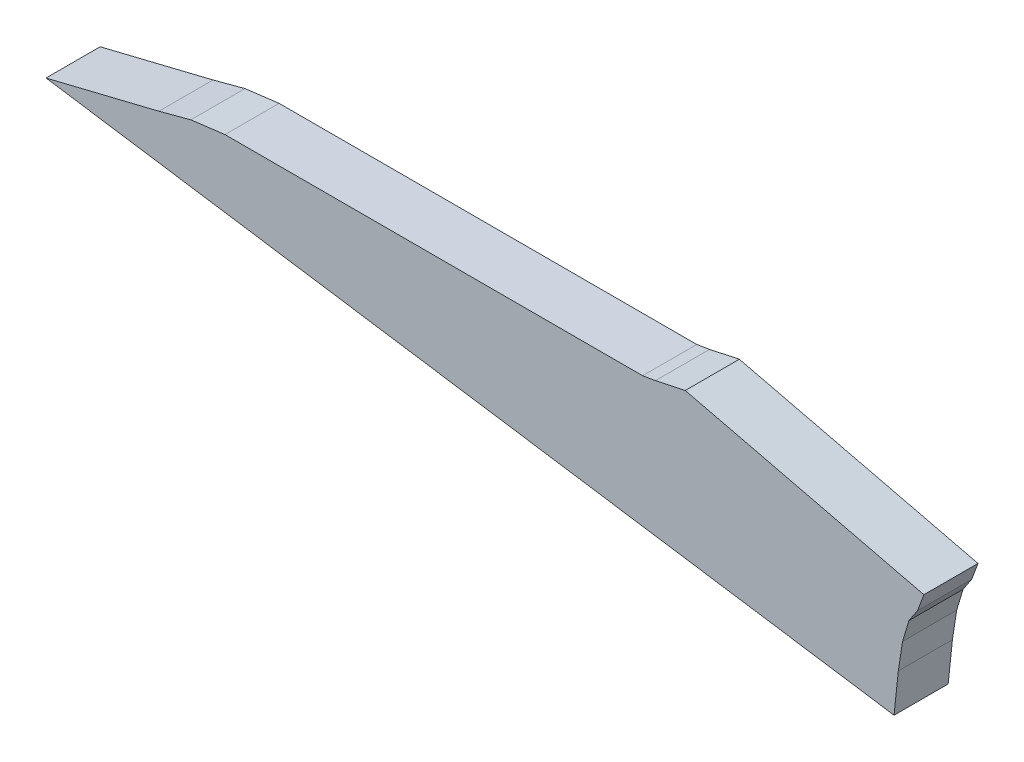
ISO-10303-21;
HEADER;
FILE_DESCRIPTION(('STEP AP214'),'2;1');
FILE_NAME('part.step','',(''),(''),'','','');
FILE_SCHEMA(('AUTOMOTIVE_DESIGN { 1 0 10303 214 1 1 1 1 }'));
ENDSEC;
DATA;
#1=APPLICATION_CONTEXT('core data for automotive mechanical design processes');
#2=APPLICATION_PROTOCOL_DEFINITION('international standard','automotive_design',2000,#1);
#3=PRODUCT_CONTEXT('',#1,'mechanical');
#4=PRODUCT('Part','Part','',(#3));
#5=PRODUCT_RELATED_PRODUCT_CATEGORY('part','',(#4));
#6=PRODUCT_DEFINITION_FORMATION('','',#4);
#7=PRODUCT_DEFINITION_CONTEXT('part definition',#1,'design');
#8=PRODUCT_DEFINITION('design','',#6,#7);
#9=PRODUCT_DEFINITION_SHAPE('','',#8);
#10=(LENGTH_UNIT() NAMED_UNIT(*) SI_UNIT(.MILLI.,.METRE.));
#11=(NAMED_UNIT(*) PLANE_ANGLE_UNIT() SI_UNIT($,.RADIAN.));
#12=(NAMED_UNIT(*) SI_UNIT($,.STERADIAN.) SOLID_ANGLE_UNIT());
#13=UNCERTAINTY_MEASURE_WITH_UNIT(LENGTH_MEASURE(1.E-05),#10,'distance_accuracy_value','');
#14=(GEOMETRIC_REPRESENTATION_CONTEXT(3) GLOBAL_UNCERTAINTY_ASSIGNED_CONTEXT((#13)) GLOBAL_UNIT_ASSIGNED_CONTEXT((#10,
#11,#12)) REPRESENTATION_CONTEXT('',''));
#15=CARTESIAN_POINT('',(0.,0.,0.));
#16=DIRECTION('',(0.,0.,1.));
#17=DIRECTION('',(1.,0.,0.));
#18=AXIS2_PLACEMENT_3D('',#15,#16,#17);
#19=CARTESIAN_POINT('',(329.,139.,-17.));
#20=DIRECTION('',(-0.238221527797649,0.971210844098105,0.));
#21=DIRECTION('',(-0.971210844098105,-0.238221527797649,0.));
#22=AXIS2_PLACEMENT_3D('',#19,#20,#21);
#23=PLANE('',#22);
#24=DIRECTION('',(-0.971210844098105,-0.238221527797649,0.));
#25=VECTOR('',#24,1.);
#26=CARTESIAN_POINT('',(329.,139.,8.4));
#27=LINE('',#26,#25);
#28=CARTESIAN_POINT('',(329.,139.,8.4));
#29=VERTEX_POINT('',#28);
#30=CARTESIAN_POINT('',(276.,126.,8.4));
#31=VERTEX_POINT('',#30);
#32=EDGE_CURVE('E159',#29,#31,#27,.T.);
#33=ORIENTED_EDGE('',*,*,#32,.F.);
#34=DIRECTION('',(0.,0.,1.));
#35=VECTOR('',#34,1.);
#36=CARTESIAN_POINT('',(329.,139.,-17.));
#37=LINE('',#36,#35);
#38=CARTESIAN_POINT('',(329.,139.,-17.));
#39=VERTEX_POINT('',#38);
#40=EDGE_CURVE('E11',#39,#29,#37,.T.);
#41=ORIENTED_EDGE('',*,*,#40,.F.);
#42=DIRECTION('',(-0.971210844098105,-0.238221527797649,0.));
#43=VECTOR('',#42,1.);
#44=CARTESIAN_POINT('',(329.,139.,-17.));
#45=LINE('',#44,#43);
#46=CARTESIAN_POINT('',(276.,126.,-17.));
#47=VERTEX_POINT('',#46);
#48=EDGE_CURVE('E194',#39,#47,#45,.T.);
#49=ORIENTED_EDGE('',*,*,#48,.T.);
#50=DIRECTION('',(0.,0.,1.));
#51=VECTOR('',#50,1.);
#52=CARTESIAN_POINT('',(276.,126.,-17.));
#53=LINE('',#52,#51);
#54=EDGE_CURVE('E35',#47,#31,#53,.T.);
#55=ORIENTED_EDGE('',*,*,#54,.T.);
#56=EDGE_LOOP('',(#33,#41,#49,#55));
#57=FACE_BOUND('',#56,.T.);
#58=ADVANCED_FACE('F32',(#57),#23,.T.);
#59=CARTESIAN_POINT('',(344.,143.,-17.));
#60=DIRECTION('',(-0.257662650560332,0.966234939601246,0.));
#61=DIRECTION('',(-0.966234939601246,-0.257662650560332,0.));
#62=AXIS2_PLACEMENT_3D('',#59,#60,#61);
#63=PLANE('',#62);
#64=DIRECTION('',(-0.966234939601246,-0.257662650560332,0.));
#65=VECTOR('',#64,1.);
#66=CARTESIAN_POINT('',(344.,143.,8.4));
#67=LINE('',#66,#65);
#68=CARTESIAN_POINT('',(344.,143.,8.4));
#69=VERTEX_POINT('',#68);
#70=EDGE_CURVE('E192',#69,#29,#67,.T.);
#71=ORIENTED_EDGE('',*,*,#70,.F.);
#72=DIRECTION('',(0.,0.,1.));
#73=VECTOR('',#72,1.);
#74=CARTESIAN_POINT('',(344.,143.,-17.));
#75=LINE('',#74,#73);
#76=CARTESIAN_POINT('',(344.,143.,-17.));
#77=VERTEX_POINT('',#76);
#78=EDGE_CURVE('E41',#77,#69,#75,.T.);
#79=ORIENTED_EDGE('',*,*,#78,.F.);
#80=DIRECTION('',(-0.966234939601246,-0.257662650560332,0.));
#81=VECTOR('',#80,1.);
#82=CARTESIAN_POINT('',(344.,143.,-17.));
#83=LINE('',#82,#81);
#84=EDGE_CURVE('E149',#77,#39,#83,.T.);
#85=ORIENTED_EDGE('',*,*,#84,.T.);
#86=ORIENTED_EDGE('',*,*,#40,.T.);
#87=EDGE_LOOP('',(#71,#79,#85,#86));
#88=FACE_BOUND('',#87,.T.);
#89=ADVANCED_FACE('F216',(#88),#63,.T.);
#90=CARTESIAN_POINT('',(360.,145.,-17.));
#91=DIRECTION('',(-0.124034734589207,0.992277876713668,0.));
#92=DIRECTION('',(-0.992277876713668,-0.124034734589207,0.));
#93=AXIS2_PLACEMENT_3D('',#90,#91,#92);
#94=PLANE('',#93);
#95=DIRECTION('',(-0.992277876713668,-0.124034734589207,0.));
#96=VECTOR('',#95,1.);
#97=CARTESIAN_POINT('',(360.,145.,8.4));
#98=LINE('',#97,#96);
#99=CARTESIAN_POINT('',(360.,145.,8.4));
#100=VERTEX_POINT('',#99);
#101=EDGE_CURVE('E136',#100,#69,#98,.T.);
#102=ORIENTED_EDGE('',*,*,#101,.F.);
#103=DIRECTION('',(0.,0.,1.));
#104=VECTOR('',#103,1.);
#105=CARTESIAN_POINT('',(360.,145.,-17.));
#106=LINE('',#105,#104);
#107=CARTESIAN_POINT('',(360.,145.,-17.));
#108=VERTEX_POINT('',#107);
#109=EDGE_CURVE('E131',#108,#100,#106,.T.);
#110=ORIENTED_EDGE('',*,*,#109,.F.);
#111=DIRECTION('',(-0.992277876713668,-0.124034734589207,0.));
#112=VECTOR('',#111,1.);
#113=CARTESIAN_POINT('',(360.,145.,-17.));
#114=LINE('',#113,#112);
#115=EDGE_CURVE('E134',#108,#77,#114,.T.);
#116=ORIENTED_EDGE('',*,*,#115,.T.);
#117=ORIENTED_EDGE('',*,*,#78,.T.);
#118=EDGE_LOOP('',(#102,#110,#116,#117));
#119=FACE_BOUND('',#118,.T.);
#120=ADVANCED_FACE('F133',(#119),#94,.T.);
#121=CARTESIAN_POINT('',(556.,145.,-17.));
#122=DIRECTION('',(0.,1.,0.));
#123=DIRECTION('',(0.,0.,1.));
#124=AXIS2_PLACEMENT_3D('',#121,#122,#123);
#125=PLANE('',#124);
#126=DIRECTION('',(-1.,0.,0.));
#127=VECTOR('',#126,1.);
#128=CARTESIAN_POINT('',(556.,145.,8.4));
#129=LINE('',#128,#127);
#130=CARTESIAN_POINT('',(556.,145.,8.4));
#131=VERTEX_POINT('',#130);
#132=EDGE_CURVE('E189',#131,#100,#129,.T.);
#133=ORIENTED_EDGE('',*,*,#132,.F.);
#134=DIRECTION('',(0.,0.,1.));
#135=VECTOR('',#134,1.);
#136=CARTESIAN_POINT('',(556.,145.,-17.));
#137=LINE('',#136,#135);
#138=CARTESIAN_POINT('',(556.,145.,-17.));
#139=VERTEX_POINT('',#138);
#140=EDGE_CURVE('E141',#139,#131,#137,.T.);
#141=ORIENTED_EDGE('',*,*,#140,.F.);
#142=DIRECTION('',(-1.,0.,0.));
#143=VECTOR('',#142,1.);
#144=CARTESIAN_POINT('',(556.,145.,-17.));
#145=LINE('',#144,#143);
#146=EDGE_CURVE('E147',#139,#108,#145,.T.);
#147=ORIENTED_EDGE('',*,*,#146,.T.);
#148=ORIENTED_EDGE('',*,*,#109,.T.);
#149=EDGE_LOOP('',(#133,#141,#147,#148));
#150=FACE_BOUND('',#149,.T.);
#151=ADVANCED_FACE('F151',(#150),#125,.T.);
#152=CARTESIAN_POINT('',(562.,146.,-17.));
#153=DIRECTION('',(-0.164398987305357,0.986393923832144,0.));
#154=DIRECTION('',(-0.986393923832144,-0.164398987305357,0.));
#155=AXIS2_PLACEMENT_3D('',#152,#153,#154);
#156=PLANE('',#155);
#157=DIRECTION('',(-0.986393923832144,-0.164398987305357,0.));
#158=VECTOR('',#157,1.);
#159=CARTESIAN_POINT('',(562.,146.,8.4));
#160=LINE('',#159,#158);
#161=CARTESIAN_POINT('',(562.,146.,8.4));
#162=VERTEX_POINT('',#161);
#163=EDGE_CURVE('E186',#162,#131,#160,.T.);
#164=ORIENTED_EDGE('',*,*,#163,.F.);
#165=DIRECTION('',(0.,0.,1.));
#166=VECTOR('',#165,1.);
#167=CARTESIAN_POINT('',(562.,146.,-17.));
#168=LINE('',#167,#166);
#169=CARTESIAN_POINT('',(562.,146.,-17.));
#170=VERTEX_POINT('',#169);
#171=EDGE_CURVE('E198',#170,#162,#168,.T.);
#172=ORIENTED_EDGE('',*,*,#171,.F.);
#173=DIRECTION('',(-0.986393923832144,-0.164398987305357,0.));
#174=VECTOR('',#173,1.);
#175=CARTESIAN_POINT('',(562.,146.,-17.));
#176=LINE('',#175,#174);
#177=EDGE_CURVE('E152',#170,#139,#176,.T.);
#178=ORIENTED_EDGE('',*,*,#177,.T.);
#179=ORIENTED_EDGE('',*,*,#140,.T.);
#180=EDGE_LOOP('',(#164,#172,#178,#179));
#181=FACE_BOUND('',#180,.T.);
#182=ADVANCED_FACE('F229',(#181),#156,.T.);
#183=CARTESIAN_POINT('',(576.,149.,-17.));
#184=DIRECTION('',(-0.209529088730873,0.97780241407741,0.));
#185=DIRECTION('',(-0.97780241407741,-0.209529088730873,0.));
#186=AXIS2_PLACEMENT_3D('',#183,#184,#185);
#187=PLANE('',#186);
#188=DIRECTION('',(-0.97780241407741,-0.209529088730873,0.));
#189=VECTOR('',#188,1.);
#190=CARTESIAN_POINT('',(576.,149.,8.4));
#191=LINE('',#190,#189);
#192=CARTESIAN_POINT('',(576.,149.,8.4));
#193=VERTEX_POINT('',#192);
#194=EDGE_CURVE('E183',#193,#162,#191,.T.);
#195=ORIENTED_EDGE('',*,*,#194,.F.);
#196=DIRECTION('',(0.,0.,1.));
#197=VECTOR('',#196,1.);
#198=CARTESIAN_POINT('',(576.,149.,-17.));
#199=LINE('',#198,#197);
#200=CARTESIAN_POINT('',(576.,149.,-17.));
#201=VERTEX_POINT('',#200);
#202=EDGE_CURVE('E200',#201,#193,#199,.T.);
#203=ORIENTED_EDGE('',*,*,#202,.F.);
#204=DIRECTION('',(-0.97780241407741,-0.209529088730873,0.));
#205=VECTOR('',#204,1.);
#206=CARTESIAN_POINT('',(576.,149.,-17.));
#207=LINE('',#206,#205);
#208=EDGE_CURVE('E154',#201,#170,#207,.T.);
#209=ORIENTED_EDGE('',*,*,#208,.T.);
#210=ORIENTED_EDGE('',*,*,#171,.T.);
#211=EDGE_LOOP('',(#195,#203,#209,#210));
#212=FACE_BOUND('',#211,.T.);
#213=ADVANCED_FACE('F232',(#212),#187,.T.);
#214=CARTESIAN_POINT('',(688.,122.,-17.));
#215=DIRECTION('',(0.234357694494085,0.972150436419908,0.));
#216=DIRECTION('',(-0.972150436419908,0.234357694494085,0.));
#217=AXIS2_PLACEMENT_3D('',#214,#215,#216);
#218=PLANE('',#217);
#219=DIRECTION('',(-0.972150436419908,0.234357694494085,0.));
#220=VECTOR('',#219,1.);
#221=CARTESIAN_POINT('',(688.,122.,8.4));
#222=LINE('',#221,#220);
#223=CARTESIAN_POINT('',(688.,122.,8.4));
#224=VERTEX_POINT('',#223);
#225=EDGE_CURVE('E180',#224,#193,#222,.T.);
#226=ORIENTED_EDGE('',*,*,#225,.F.);
#227=DIRECTION('',(0.,0.,1.));
#228=VECTOR('',#227,1.);
#229=CARTESIAN_POINT('',(688.,122.,-17.));
#230=LINE('',#229,#228);
#231=CARTESIAN_POINT('',(688.,122.,-17.));
#232=VERTEX_POINT('',#231);
#233=EDGE_CURVE('E202',#232,#224,#230,.T.);
#234=ORIENTED_EDGE('',*,*,#233,.F.);
#235=DIRECTION('',(-0.972150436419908,0.234357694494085,0.));
#236=VECTOR('',#235,1.);
#237=CARTESIAN_POINT('',(688.,122.,-17.));
#238=LINE('',#237,#236);
#239=EDGE_CURVE('E372',#232,#201,#238,.T.);
#240=ORIENTED_EDGE('',*,*,#239,.T.);
#241=ORIENTED_EDGE('',*,*,#202,.T.);
#242=EDGE_LOOP('',(#226,#234,#240,#241));
#243=FACE_BOUND('',#242,.T.);
#244=ADVANCED_FACE('F236',(#243),#218,.T.);
#245=CARTESIAN_POINT('',(685.,114.,-17.));
#246=DIRECTION('',(0.936329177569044,-0.351123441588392,0.));
#247=DIRECTION('',(0.351123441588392,0.936329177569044,0.));
#248=AXIS2_PLACEMENT_3D('',#245,#246,#247);
#249=PLANE('',#248);
#250=DIRECTION('',(0.351123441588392,0.936329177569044,0.));
#251=VECTOR('',#250,1.);
#252=CARTESIAN_POINT('',(685.,114.,8.4));
#253=LINE('',#252,#251);
#254=CARTESIAN_POINT('',(685.,114.,8.4));
#255=VERTEX_POINT('',#254);
#256=EDGE_CURVE('E177',#255,#224,#253,.T.);
#257=ORIENTED_EDGE('',*,*,#256,.F.);
#258=DIRECTION('',(0.,0.,1.));
#259=VECTOR('',#258,1.);
#260=CARTESIAN_POINT('',(685.,114.,-17.));
#261=LINE('',#260,#259);
#262=CARTESIAN_POINT('',(685.,114.,-17.));
#263=VERTEX_POINT('',#262);
#264=EDGE_CURVE('E204',#263,#255,#261,.T.);
#265=ORIENTED_EDGE('',*,*,#264,.F.);
#266=DIRECTION('',(0.351123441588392,0.936329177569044,0.));
#267=VECTOR('',#266,1.);
#268=CARTESIAN_POINT('',(685.,114.,-17.));
#269=LINE('',#268,#267);
#270=EDGE_CURVE('E368',#263,#232,#269,.T.);
#271=ORIENTED_EDGE('',*,*,#270,.T.);
#272=ORIENTED_EDGE('',*,*,#233,.T.);
#273=EDGE_LOOP('',(#257,#265,#271,#272));
#274=FACE_BOUND('',#273,.T.);
#275=ADVANCED_FACE('F240',(#274),#249,.T.);
#276=CARTESIAN_POINT('',(681.,108.,-17.));
#277=DIRECTION('',(0.832050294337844,-0.554700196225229,0.));
#278=DIRECTION('',(0.554700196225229,0.832050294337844,0.));
#279=AXIS2_PLACEMENT_3D('',#276,#277,#278);
#280=PLANE('',#279);
#281=DIRECTION('',(0.554700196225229,0.832050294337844,0.));
#282=VECTOR('',#281,1.);
#283=CARTESIAN_POINT('',(681.,108.,8.4));
#284=LINE('',#283,#282);
#285=CARTESIAN_POINT('',(681.,108.,8.4));
#286=VERTEX_POINT('',#285);
#287=EDGE_CURVE('E174',#286,#255,#284,.T.);
#288=ORIENTED_EDGE('',*,*,#287,.F.);
#289=DIRECTION('',(0.,0.,1.));
#290=VECTOR('',#289,1.);
#291=CARTESIAN_POINT('',(681.,108.,-17.));
#292=LINE('',#291,#290);
#293=CARTESIAN_POINT('',(681.,108.,-17.));
#294=VERTEX_POINT('',#293);
#295=EDGE_CURVE('E206',#294,#286,#292,.T.);
#296=ORIENTED_EDGE('',*,*,#295,.F.);
#297=DIRECTION('',(0.554700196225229,0.832050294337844,0.));
#298=VECTOR('',#297,1.);
#299=CARTESIAN_POINT('',(681.,108.,-17.));
#300=LINE('',#299,#298);
#301=EDGE_CURVE('E379',#294,#263,#300,.T.);
#302=ORIENTED_EDGE('',*,*,#301,.T.);
#303=ORIENTED_EDGE('',*,*,#264,.T.);
#304=EDGE_LOOP('',(#288,#296,#302,#303));
#305=FACE_BOUND('',#304,.T.);
#306=ADVANCED_FACE('F244',(#305),#280,.T.);
#307=CARTESIAN_POINT('',(678.,98.,-17.));
#308=DIRECTION('',(0.957826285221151,-0.287347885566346,0.));
#309=DIRECTION('',(0.287347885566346,0.957826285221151,0.));
#310=AXIS2_PLACEMENT_3D('',#307,#308,#309);
#311=PLANE('',#310);
#312=DIRECTION('',(0.287347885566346,0.957826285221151,0.));
#313=VECTOR('',#312,1.);
#314=CARTESIAN_POINT('',(678.,98.,8.4));
#315=LINE('',#314,#313);
#316=CARTESIAN_POINT('',(678.,98.,8.4));
#317=VERTEX_POINT('',#316);
#318=EDGE_CURVE('E171',#317,#286,#315,.T.);
#319=ORIENTED_EDGE('',*,*,#318,.F.);
#320=DIRECTION('',(0.,0.,1.));
#321=VECTOR('',#320,1.);
#322=CARTESIAN_POINT('',(678.,98.,-17.));
#323=LINE('',#322,#321);
#324=CARTESIAN_POINT('',(678.,98.,-17.));
#325=VERTEX_POINT('',#324);
#326=EDGE_CURVE('E208',#325,#317,#323,.T.);
#327=ORIENTED_EDGE('',*,*,#326,.F.);
#328=DIRECTION('',(0.287347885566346,0.957826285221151,0.));
#329=VECTOR('',#328,1.);
#330=CARTESIAN_POINT('',(678.,98.,-17.));
#331=LINE('',#330,#329);
#332=EDGE_CURVE('E361',#325,#294,#331,.T.);
#333=ORIENTED_EDGE('',*,*,#332,.T.);
#334=ORIENTED_EDGE('',*,*,#295,.T.);
#335=EDGE_LOOP('',(#319,#327,#333,#334));
#336=FACE_BOUND('',#335,.T.);
#337=ADVANCED_FACE('F248',(#336),#311,.T.);
#338=CARTESIAN_POINT('',(676.,85.,-17.));
#339=DIRECTION('',(0.988371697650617,-0.152057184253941,0.));
#340=DIRECTION('',(0.152057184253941,0.988371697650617,0.));
#341=AXIS2_PLACEMENT_3D('',#338,#339,#340);
#342=PLANE('',#341);
#343=DIRECTION('',(0.152057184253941,0.988371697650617,0.));
#344=VECTOR('',#343,1.);
#345=CARTESIAN_POINT('',(676.,85.,8.4));
#346=LINE('',#345,#344);
#347=CARTESIAN_POINT('',(676.,85.,8.4));
#348=VERTEX_POINT('',#347);
#349=EDGE_CURVE('E168',#348,#317,#346,.T.);
#350=ORIENTED_EDGE('',*,*,#349,.F.);
#351=DIRECTION('',(0.,0.,1.));
#352=VECTOR('',#351,1.);
#353=CARTESIAN_POINT('',(676.,85.,-17.));
#354=LINE('',#353,#352);
#355=CARTESIAN_POINT('',(676.,85.,-17.));
#356=VERTEX_POINT('',#355);
#357=EDGE_CURVE('E210',#356,#348,#354,.T.);
#358=ORIENTED_EDGE('',*,*,#357,.F.);
#359=DIRECTION('',(0.152057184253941,0.988371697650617,0.));
#360=VECTOR('',#359,1.);
#361=CARTESIAN_POINT('',(676.,85.,-17.));
#362=LINE('',#361,#360);
#363=EDGE_CURVE('E357',#356,#325,#362,.T.);
#364=ORIENTED_EDGE('',*,*,#363,.T.);
#365=ORIENTED_EDGE('',*,*,#326,.T.);
#366=EDGE_LOOP('',(#350,#358,#364,#365));
#367=FACE_BOUND('',#366,.T.);
#368=ADVANCED_FACE('F252',(#367),#342,.T.);
#369=CARTESIAN_POINT('',(674.,66.,-17.));
#370=DIRECTION('',(0.994505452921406,-0.104684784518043,0.));
#371=DIRECTION('',(0.104684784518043,0.994505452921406,0.));
#372=AXIS2_PLACEMENT_3D('',#369,#370,#371);
#373=PLANE('',#372);
#374=DIRECTION('',(0.104684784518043,0.994505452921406,0.));
#375=VECTOR('',#374,1.);
#376=CARTESIAN_POINT('',(674.,66.,8.4));
#377=LINE('',#376,#375);
#378=CARTESIAN_POINT('',(674.,66.,8.4));
#379=VERTEX_POINT('',#378);
#380=EDGE_CURVE('E165',#379,#348,#377,.T.);
#381=ORIENTED_EDGE('',*,*,#380,.F.);
#382=DIRECTION('',(0.,0.,1.));
#383=VECTOR('',#382,1.);
#384=CARTESIAN_POINT('',(674.,66.,-17.));
#385=LINE('',#384,#383);
#386=CARTESIAN_POINT('',(674.,66.,-17.));
#387=VERTEX_POINT('',#386);
#388=EDGE_CURVE('E211',#387,#379,#385,.T.);
#389=ORIENTED_EDGE('',*,*,#388,.F.);
#390=DIRECTION('',(0.104684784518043,0.994505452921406,0.));
#391=VECTOR('',#390,1.);
#392=CARTESIAN_POINT('',(674.,66.,-17.));
#393=LINE('',#392,#391);
#394=EDGE_CURVE('E383',#387,#356,#393,.T.);
#395=ORIENTED_EDGE('',*,*,#394,.T.);
#396=ORIENTED_EDGE('',*,*,#357,.T.);
#397=EDGE_LOOP('',(#381,#389,#395,#396));
#398=FACE_BOUND('',#397,.T.);
#399=ADVANCED_FACE('F256',(#398),#373,.T.);
#400=CARTESIAN_POINT('',(276.,126.,-17.));
#401=DIRECTION('',(-0.1490693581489,-0.988826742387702,0.));
#402=DIRECTION('',(0.988826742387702,-0.1490693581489,0.));
#403=AXIS2_PLACEMENT_3D('',#400,#401,#402);
#404=PLANE('',#403);
#405=DIRECTION('',(0.988826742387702,-0.1490693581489,0.));
#406=VECTOR('',#405,1.);
#407=CARTESIAN_POINT('',(276.,126.,8.4));
#408=LINE('',#407,#406);
#409=EDGE_CURVE('E162',#31,#379,#408,.T.);
#410=ORIENTED_EDGE('',*,*,#409,.F.);
#411=ORIENTED_EDGE('',*,*,#54,.F.);
#412=DIRECTION('',(0.988826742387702,-0.1490693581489,0.));
#413=VECTOR('',#412,1.);
#414=CARTESIAN_POINT('',(276.,126.,-17.));
#415=LINE('',#414,#413);
#416=EDGE_CURVE('E385',#47,#387,#415,.T.);
#417=ORIENTED_EDGE('',*,*,#416,.T.);
#418=ORIENTED_EDGE('',*,*,#388,.T.);
#419=EDGE_LOOP('',(#410,#411,#417,#418));
#420=FACE_BOUND('',#419,.T.);
#421=ADVANCED_FACE('F213',(#420),#404,.T.);
#422=CARTESIAN_POINT('',(691.031600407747,227.800203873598,-17.));
#423=DIRECTION('',(0.,0.,-1.));
#424=DIRECTION('',(-1.,0.,0.));
#425=AXIS2_PLACEMENT_3D('',#422,#423,#424);
#426=PLANE('',#425);
#427=ORIENTED_EDGE('',*,*,#48,.F.);
#428=ORIENTED_EDGE('',*,*,#84,.F.);
#429=ORIENTED_EDGE('',*,*,#115,.F.);
#430=ORIENTED_EDGE('',*,*,#146,.F.);
#431=ORIENTED_EDGE('',*,*,#177,.F.);
#432=ORIENTED_EDGE('',*,*,#208,.F.);
#433=ORIENTED_EDGE('',*,*,#239,.F.);
#434=ORIENTED_EDGE('',*,*,#270,.F.);
#435=ORIENTED_EDGE('',*,*,#301,.F.);
#436=ORIENTED_EDGE('',*,*,#332,.F.);
#437=ORIENTED_EDGE('',*,*,#363,.F.);
#438=ORIENTED_EDGE('',*,*,#394,.F.);
#439=ORIENTED_EDGE('',*,*,#416,.F.);
#440=EDGE_LOOP('',(#427,#428,#429,#430,#431,#432,#433,#434,#435,#436,#437,#438,#439));
#441=FACE_BOUND('',#440,.T.);
#442=ADVANCED_FACE('F145',(#441),#426,.T.);
#443=CARTESIAN_POINT('',(691.031600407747,227.800203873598,8.4));
#444=DIRECTION('',(0.,0.,-1.));
#445=DIRECTION('',(-1.,0.,0.));
#446=AXIS2_PLACEMENT_3D('',#443,#444,#445);
#447=PLANE('',#446);
#448=ORIENTED_EDGE('',*,*,#32,.T.);
#449=ORIENTED_EDGE('',*,*,#409,.T.);
#450=ORIENTED_EDGE('',*,*,#380,.T.);
#451=ORIENTED_EDGE('',*,*,#349,.T.);
#452=ORIENTED_EDGE('',*,*,#318,.T.);
#453=ORIENTED_EDGE('',*,*,#287,.T.);
#454=ORIENTED_EDGE('',*,*,#256,.T.);
#455=ORIENTED_EDGE('',*,*,#225,.T.);
#456=ORIENTED_EDGE('',*,*,#194,.T.);
#457=ORIENTED_EDGE('',*,*,#163,.T.);
#458=ORIENTED_EDGE('',*,*,#132,.T.);
#459=ORIENTED_EDGE('',*,*,#101,.T.);
#460=ORIENTED_EDGE('',*,*,#70,.T.);
#461=EDGE_LOOP('',(#448,#449,#450,#451,#452,#453,#454,#455,#456,#457,#458,#459,#460));
#462=FACE_BOUND('',#461,.T.);
#463=ADVANCED_FACE('F215',(#462),#447,.F.);
#464=CLOSED_SHELL('',(#58,#89,#120,#151,#182,#213,#244,#275,#306,#337,#368,#399,#421,#442,#463));
#465=MANIFOLD_SOLID_BREP('B2',#464);
#466=ADVANCED_BREP_SHAPE_REPRESENTATION('',(#18,#465),#14);
#467=SHAPE_DEFINITION_REPRESENTATION(#9,#466);
ENDSEC;
END-ISO-10303-21;
